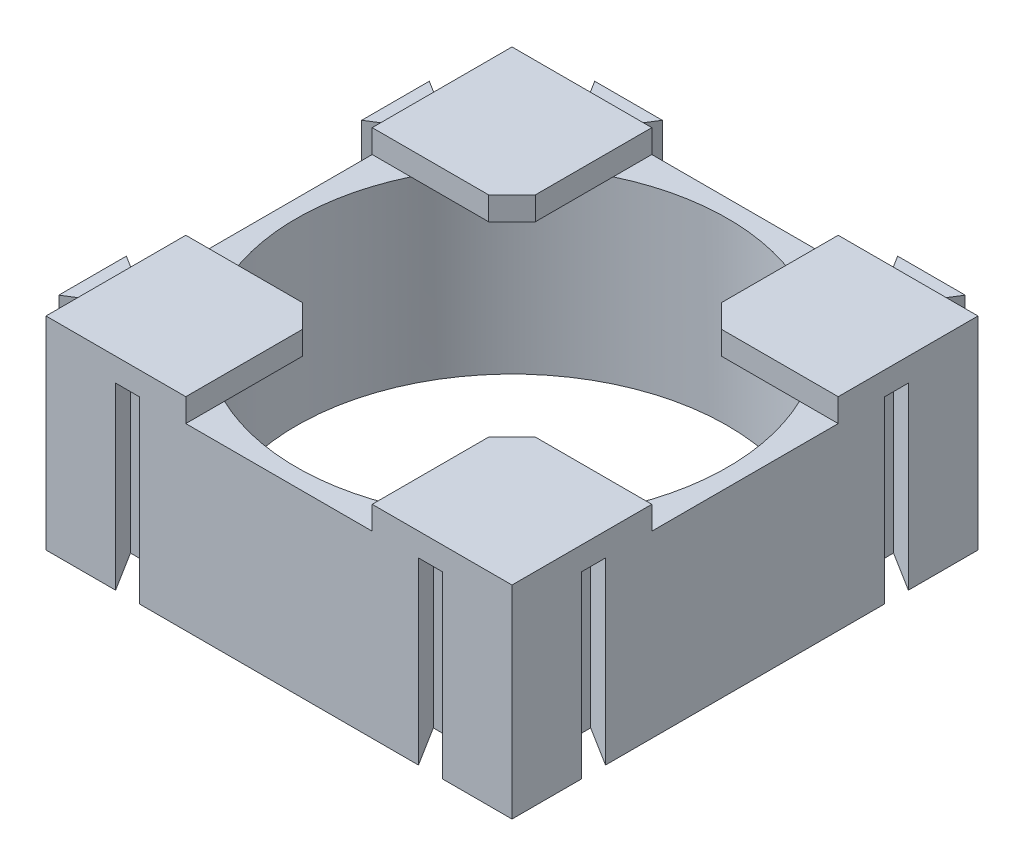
from build123d import *

# Parameters (mm, degrees)
SKETCH1_R           = 9.25
BOSS_EXTRUDE1_DEPTH = 7.7
BOSS_EXTRUDE2_DEPTH = 1


with BuildPart() as part:
    # Sketch1 → Boss-Extrude1 (new body)
    with BuildSketch(Plane(origin=(0, 0, 0), x_dir=(1, 0, 0), z_dir=(0, 1, 0))):
        Polygon((-7.012695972, 10), (-7.95, 11.5), (-5.05, 11.5), (-5.987304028, 10), (5.987304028, 10), (5.05, 11.5), (7.95, 11.5), (7.012695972, 10), (10, 10), (10, 7.012695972), (8.3, 8.07497387), (8.3, 4.92502613), (10, 5.987304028), (10, -5.987304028), (8.3, -4.92502613), (8.3, -8.07497387), (10, -7.012695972), (10, -10), (7.012695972, -10), (8.07497387, -8.3), (4.92502613, -8.3), (5.987304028, -10), (-5.987304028, -10), (-4.92502613, -8.3), (-8.07497387, -8.3), (-7.012695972, -10), (-10, -10), (-10, -7.012695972), (-11.5, -7.95), (-11.5, -5.05), (-10, -5.987304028), (-10, 5.987304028), (-11.5, 5.05), (-11.5, 7.95), (-10, 7.012695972), (-10, 10), align=None)
        with Locations(Location((0, 0, 0), (0, 0, 90))):
            Circle(SKETCH1_R, mode=Mode.SUBTRACT)
    extrude(amount=BOSS_EXTRUDE1_DEPTH)

    # Sketch2 → Boss-Extrude2 (add)
    with BuildSketch(Plane(origin=(0, 7.7, 0), x_dir=(1, 0, 0), z_dir=(0, 1, 0))):
        Polygon((-5, -4), (-4, -5), (-4, -10), (-10, -10), (-10, -4), align=None)
        Polygon((-4, 10), (-4, 5), (-5, 4), (-10, 4), (-10, 10), align=None)
        Polygon((10, 4), (5, 4), (4, 5), (4, 10), (10, 10), align=None)
        Polygon((4, -10), (4, -5), (5, -4), (10, -4), (10, -10), align=None)
    extrude(amount=BOSS_EXTRUDE2_DEPTH)


solid = part.part
